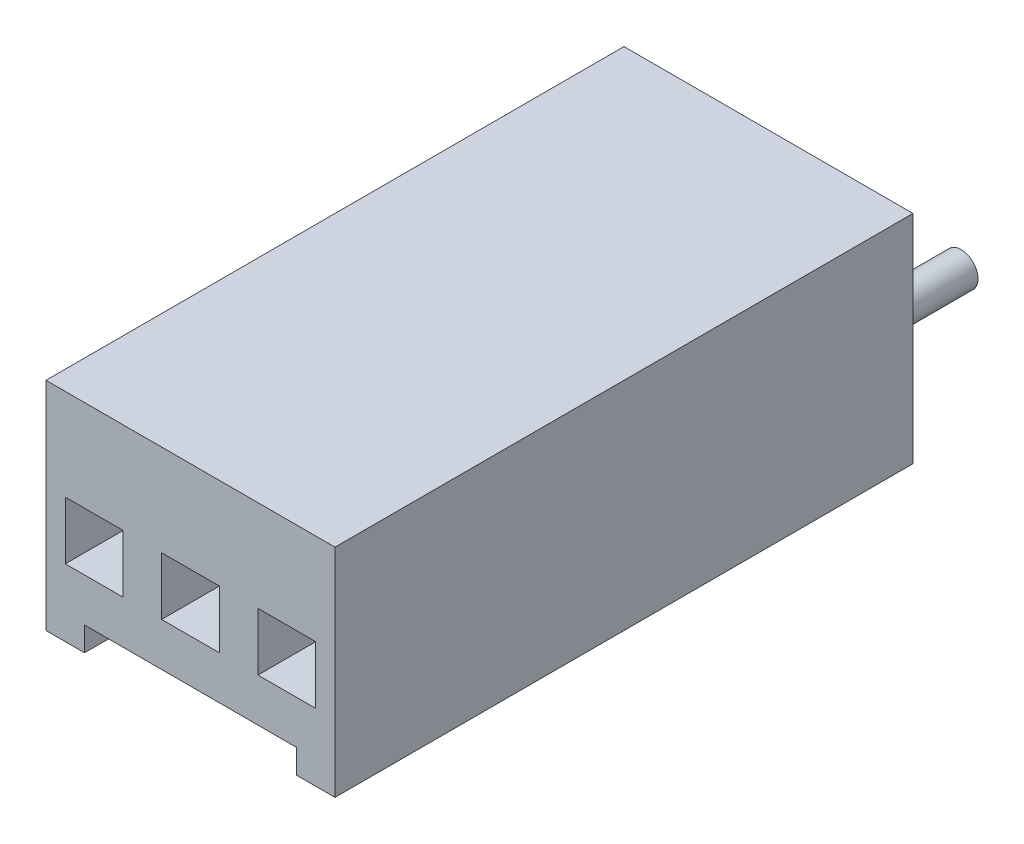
from build123d import *

# Parameters (mm, degrees)
SKETCH2_W           = 7.62
SKETCH2_H           = 5.715
BOSS_EXTRUDE2_DEPTH = 2.54
SKETCH3_W           = 5.08
SKETCH3_H           = 0.635
BOSS_EXTRUDE3_DEPTH = 7.62
SKETCH4_W           = 7.62
SKETCH4_H           = 5.08
BOSS_EXTRUDE4_DEPTH = 12.7
SKETCH5_R           = 0.4445
BOSS_EXTRUDE5_DEPTH = 2.54
SKETCH_2_W          = 1.016
SKETCH_2_H          = 12.7
EXTRUDE_1_DEPTH     = 0.635
SKETCH_3_W          = 1.524
SKETCH_3_H          = 1.524
CUT_EXTRUDE_1_DEPTH = 12.7


with BuildPart() as part:
    # Sketch2 → Boss-Extrude2 (new body)
    with BuildSketch(Plane.XY):
        with Locations((2.54, 0.3175)):
            Rectangle(SKETCH2_W, SKETCH2_H)
    extrude(amount=BOSS_EXTRUDE2_DEPTH)

    # Sketch3 → Boss-Extrude3 (add)
    with BuildSketch(Plane.XY.offset(2.54)):
        with Locations((2.54, -2.2225)):
            Rectangle(SKETCH3_W, SKETCH3_H)
    extrude(amount=BOSS_EXTRUDE3_DEPTH)

    # Sketch4 → Boss-Extrude4 (add)
    with BuildSketch(Plane.XY.offset(2.54)):
        with Locations((2.54, 0.635)):
            Rectangle(SKETCH4_W, SKETCH4_H)
    extrude(amount=BOSS_EXTRUDE4_DEPTH)

    # Sketch5 → Boss-Extrude5 (add)
    with BuildSketch(Plane(origin=(0, 0, 0), x_dir=(-1, 0, 0), z_dir=(0, 0, -1))):
        with Locations(Location((0, 0, 0), (0, 0, 180))):
            Circle(SKETCH5_R)
        with Locations(Location((-2.54, 0, 0), (0, 0, 180))):
            Circle(SKETCH5_R)
        with Locations(Location((-5.08, 0, 0), (0, 0, 180))):
            Circle(SKETCH5_R)
    extrude(amount=BOSS_EXTRUDE5_DEPTH)

    # Sketch 2 → Extrude 1 (add)
    with BuildSketch(Plane.XZ.offset(1.905)):
        with Locations((-0.762, 8.89)):
            Rectangle(SKETCH_2_W, SKETCH_2_H)
        with Locations((5.842, 8.89)):
            Rectangle(SKETCH_2_W, SKETCH_2_H)
    extrude(amount=EXTRUDE_1_DEPTH)

    # Sketch 3 → Cut-Extrude 1 (cut)
    with BuildSketch(Plane.XY.offset(15.24)):
        Rectangle(SKETCH_3_W, SKETCH_3_H)
        with Locations((2.54, 0)):
            Rectangle(SKETCH_3_W, SKETCH_3_H)
        with Locations((5.08, 0)):
            Rectangle(SKETCH_3_W, SKETCH_3_H)
    extrude(amount=-CUT_EXTRUDE_1_DEPTH, mode=Mode.SUBTRACT)


solid = part.part
